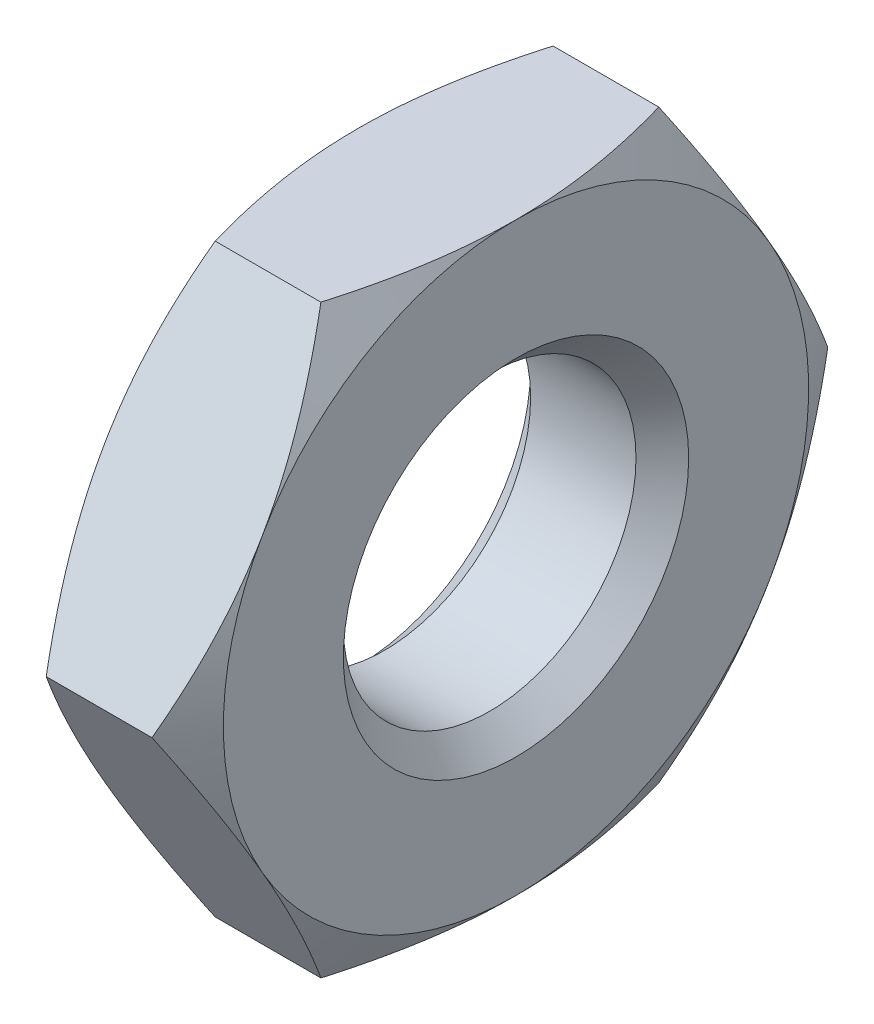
from build123d import *

# Parameters (mm, degrees)
SKETCH1_R      = 1.25
EXTRUDE1_DEPTH = 1.35
CHAMFER1_SIZE  = 0.225


with BuildPart() as part:
    # Sketch1 → Extrude1 (new body)
    with BuildSketch(Plane(origin=(0, 0, 0), x_dir=(0, 0, -1), z_dir=(1, 0, 0))):
        Polygon((1.443375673, 2.5), (-1.443375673, 2.5), (-2.886751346, 0), (-1.443375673, -2.5), (1.443375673, -2.5), (2.886751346, 0), align=None)
        with Locations(Location((0, 0, 0), (0, 0, 180))):
            Circle(SKETCH1_R, mode=Mode.SUBTRACT)
    extrude(amount=EXTRUDE1_DEPTH)

    # Sketch2 → Cut-Revolve1 (revolve, cut)
    with BuildSketch(Plane.XY):
        Polygon((1.35, 2.5), (1.35, 10), (0, 10), (0, 2.5), (0.675, 3.669134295), align=None)
    revolve(axis=Axis((1.35, 0, 0), (-1, 0, 0)), mode=Mode.SUBTRACT)

    # Chamfer1
    chamfer1_edges = [part.edges().sort_by_distance(p)[0] for p in [
        (0, 0, -1.25),
        (1.35, 0, -1.25),
    ]]
    chamfer(chamfer1_edges, length=CHAMFER1_SIZE)


solid = part.part
